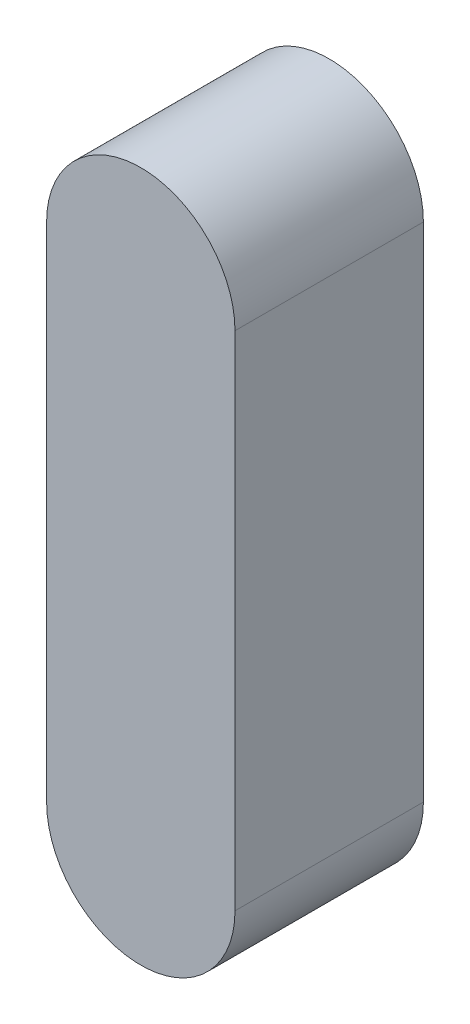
ISO-10303-21;
HEADER;
FILE_DESCRIPTION(('STEP AP214'),'2;1');
FILE_NAME('part.step','',(''),(''),'','','');
FILE_SCHEMA(('AUTOMOTIVE_DESIGN { 1 0 10303 214 1 1 1 1 }'));
ENDSEC;
DATA;
#1=APPLICATION_CONTEXT('core data for automotive mechanical design processes');
#2=APPLICATION_PROTOCOL_DEFINITION('international standard','automotive_design',2000,#1);
#3=PRODUCT_CONTEXT('',#1,'mechanical');
#4=PRODUCT('Part','Part','',(#3));
#5=PRODUCT_RELATED_PRODUCT_CATEGORY('part','',(#4));
#6=PRODUCT_DEFINITION_FORMATION('','',#4);
#7=PRODUCT_DEFINITION_CONTEXT('part definition',#1,'design');
#8=PRODUCT_DEFINITION('design','',#6,#7);
#9=PRODUCT_DEFINITION_SHAPE('','',#8);
#10=(LENGTH_UNIT() NAMED_UNIT(*) SI_UNIT(.MILLI.,.METRE.));
#11=(NAMED_UNIT(*) PLANE_ANGLE_UNIT() SI_UNIT($,.RADIAN.));
#12=(NAMED_UNIT(*) SI_UNIT($,.STERADIAN.) SOLID_ANGLE_UNIT());
#13=UNCERTAINTY_MEASURE_WITH_UNIT(LENGTH_MEASURE(1.E-05),#10,'distance_accuracy_value','');
#14=(GEOMETRIC_REPRESENTATION_CONTEXT(3) GLOBAL_UNCERTAINTY_ASSIGNED_CONTEXT((#13)) GLOBAL_UNIT_ASSIGNED_CONTEXT((#10,
#11,#12)) REPRESENTATION_CONTEXT('',''));
#15=CARTESIAN_POINT('',(0.,0.,0.));
#16=DIRECTION('',(0.,0.,1.));
#17=DIRECTION('',(1.,0.,0.));
#18=AXIS2_PLACEMENT_3D('',#15,#16,#17);
#19=CARTESIAN_POINT('',(0.,8.00000000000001,3.));
#20=DIRECTION('',(0.,0.,-1.));
#21=DIRECTION('',(-1.,0.,0.));
#22=AXIS2_PLACEMENT_3D('',#19,#20,#21);
#23=CYLINDRICAL_SURFACE('',#22,1.5);
#24=CARTESIAN_POINT('',(0.,8.00000000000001,0.));
#25=DIRECTION('',(0.,0.,1.));
#26=DIRECTION('',(1.,0.,0.));
#27=AXIS2_PLACEMENT_3D('',#24,#25,#26);
#28=CIRCLE('',#27,1.5);
#29=CARTESIAN_POINT('',(1.5,8.00000000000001,0.));
#30=VERTEX_POINT('',#29);
#31=CARTESIAN_POINT('',(-1.5,8.00000000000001,0.));
#32=VERTEX_POINT('',#31);
#33=EDGE_CURVE('E78',#30,#32,#28,.T.);
#34=ORIENTED_EDGE('',*,*,#33,.T.);
#35=DIRECTION('',(0.,0.,-1.));
#36=VECTOR('',#35,1.);
#37=CARTESIAN_POINT('',(-1.5,8.00000000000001,3.));
#38=LINE('',#37,#36);
#39=CARTESIAN_POINT('',(-1.5,8.00000000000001,3.));
#40=VERTEX_POINT('',#39);
#41=EDGE_CURVE('E11',#40,#32,#38,.T.);
#42=ORIENTED_EDGE('',*,*,#41,.F.);
#43=CARTESIAN_POINT('',(0.,8.00000000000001,3.));
#44=DIRECTION('',(0.,0.,1.));
#45=DIRECTION('',(1.,0.,0.));
#46=AXIS2_PLACEMENT_3D('',#43,#44,#45);
#47=CIRCLE('',#46,1.5);
#48=CARTESIAN_POINT('',(1.5,8.00000000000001,3.));
#49=VERTEX_POINT('',#48);
#50=EDGE_CURVE('E96',#49,#40,#47,.T.);
#51=ORIENTED_EDGE('',*,*,#50,.F.);
#52=DIRECTION('',(0.,0.,-1.));
#53=VECTOR('',#52,1.);
#54=CARTESIAN_POINT('',(1.5,8.00000000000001,3.));
#55=LINE('',#54,#53);
#56=EDGE_CURVE('E90',#49,#30,#55,.T.);
#57=ORIENTED_EDGE('',*,*,#56,.T.);
#58=EDGE_LOOP('',(#34,#42,#51,#57));
#59=FACE_BOUND('',#58,.T.);
#60=ADVANCED_FACE('F34',(#59),#23,.T.);
#61=CARTESIAN_POINT('',(-1.5,8.00000000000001,3.));
#62=DIRECTION('',(1.,0.,0.));
#63=DIRECTION('',(0.,0.,-1.));
#64=AXIS2_PLACEMENT_3D('',#61,#62,#63);
#65=PLANE('',#64);
#66=DIRECTION('',(0.,-1.,0.));
#67=VECTOR('',#66,1.);
#68=CARTESIAN_POINT('',(-1.5,8.00000000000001,0.));
#69=LINE('',#68,#67);
#70=CARTESIAN_POINT('',(-1.5,0.,0.));
#71=VERTEX_POINT('',#70);
#72=EDGE_CURVE('E74',#32,#71,#69,.T.);
#73=ORIENTED_EDGE('',*,*,#72,.T.);
#74=DIRECTION('',(0.,0.,-1.));
#75=VECTOR('',#74,1.);
#76=CARTESIAN_POINT('',(-1.5,0.,3.));
#77=LINE('',#76,#75);
#78=CARTESIAN_POINT('',(-1.5,0.,3.));
#79=VERTEX_POINT('',#78);
#80=EDGE_CURVE('E41',#79,#71,#77,.T.);
#81=ORIENTED_EDGE('',*,*,#80,.F.);
#82=DIRECTION('',(0.,-1.,0.));
#83=VECTOR('',#82,1.);
#84=CARTESIAN_POINT('',(-1.5,8.00000000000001,3.));
#85=LINE('',#84,#83);
#86=EDGE_CURVE('E86',#40,#79,#85,.T.);
#87=ORIENTED_EDGE('',*,*,#86,.F.);
#88=ORIENTED_EDGE('',*,*,#41,.T.);
#89=EDGE_LOOP('',(#73,#81,#87,#88));
#90=FACE_BOUND('',#89,.T.);
#91=ADVANCED_FACE('F85',(#90),#65,.F.);
#92=CARTESIAN_POINT('',(0.,0.,3.));
#93=DIRECTION('',(0.,0.,-1.));
#94=DIRECTION('',(-1.,0.,0.));
#95=AXIS2_PLACEMENT_3D('',#92,#93,#94);
#96=CYLINDRICAL_SURFACE('',#95,1.5);
#97=CARTESIAN_POINT('',(0.,0.,0.));
#98=DIRECTION('',(0.,0.,1.));
#99=DIRECTION('',(1.,0.,0.));
#100=AXIS2_PLACEMENT_3D('',#97,#98,#99);
#101=CIRCLE('',#100,1.5);
#102=CARTESIAN_POINT('',(1.5,0.,0.));
#103=VERTEX_POINT('',#102);
#104=EDGE_CURVE('E79',#71,#103,#101,.T.);
#105=ORIENTED_EDGE('',*,*,#104,.T.);
#106=DIRECTION('',(0.,0.,-1.));
#107=VECTOR('',#106,1.);
#108=CARTESIAN_POINT('',(1.5,0.,3.));
#109=LINE('',#108,#107);
#110=CARTESIAN_POINT('',(1.5,0.,3.));
#111=VERTEX_POINT('',#110);
#112=EDGE_CURVE('E102',#111,#103,#109,.T.);
#113=ORIENTED_EDGE('',*,*,#112,.F.);
#114=CARTESIAN_POINT('',(0.,0.,3.));
#115=DIRECTION('',(0.,0.,1.));
#116=DIRECTION('',(1.,0.,0.));
#117=AXIS2_PLACEMENT_3D('',#114,#115,#116);
#118=CIRCLE('',#117,1.5);
#119=EDGE_CURVE('E53',#79,#111,#118,.T.);
#120=ORIENTED_EDGE('',*,*,#119,.F.);
#121=ORIENTED_EDGE('',*,*,#80,.T.);
#122=EDGE_LOOP('',(#105,#113,#120,#121));
#123=FACE_BOUND('',#122,.T.);
#124=ADVANCED_FACE('F105',(#123),#96,.T.);
#125=CARTESIAN_POINT('',(1.5,8.00000000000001,3.));
#126=DIRECTION('',(-1.,0.,0.));
#127=DIRECTION('',(0.,0.,1.));
#128=AXIS2_PLACEMENT_3D('',#125,#126,#127);
#129=PLANE('',#128);
#130=DIRECTION('',(0.,1.,0.));
#131=VECTOR('',#130,1.);
#132=CARTESIAN_POINT('',(1.5,8.00000000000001,0.));
#133=LINE('',#132,#131);
#134=EDGE_CURVE('E94',#103,#30,#133,.T.);
#135=ORIENTED_EDGE('',*,*,#134,.T.);
#136=ORIENTED_EDGE('',*,*,#56,.F.);
#137=DIRECTION('',(0.,1.,0.));
#138=VECTOR('',#137,1.);
#139=CARTESIAN_POINT('',(1.5,8.00000000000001,3.));
#140=LINE('',#139,#138);
#141=EDGE_CURVE('E48',#111,#49,#140,.T.);
#142=ORIENTED_EDGE('',*,*,#141,.F.);
#143=ORIENTED_EDGE('',*,*,#112,.T.);
#144=EDGE_LOOP('',(#135,#136,#142,#143));
#145=FACE_BOUND('',#144,.T.);
#146=ADVANCED_FACE('F107',(#145),#129,.F.);
#147=CARTESIAN_POINT('',(0.,8.00000000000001,3.));
#148=DIRECTION('',(0.,0.,1.));
#149=DIRECTION('',(1.,0.,0.));
#150=AXIS2_PLACEMENT_3D('',#147,#148,#149);
#151=PLANE('',#150);
#152=ORIENTED_EDGE('',*,*,#50,.T.);
#153=ORIENTED_EDGE('',*,*,#86,.T.);
#154=ORIENTED_EDGE('',*,*,#119,.T.);
#155=ORIENTED_EDGE('',*,*,#141,.T.);
#156=EDGE_LOOP('',(#152,#153,#154,#155));
#157=FACE_BOUND('',#156,.T.);
#158=ADVANCED_FACE('F108',(#157),#151,.T.);
#159=CARTESIAN_POINT('',(0.,8.00000000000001,0.));
#160=DIRECTION('',(0.,0.,1.));
#161=DIRECTION('',(1.,0.,0.));
#162=AXIS2_PLACEMENT_3D('',#159,#160,#161);
#163=PLANE('',#162);
#164=ORIENTED_EDGE('',*,*,#33,.F.);
#165=ORIENTED_EDGE('',*,*,#134,.F.);
#166=ORIENTED_EDGE('',*,*,#104,.F.);
#167=ORIENTED_EDGE('',*,*,#72,.F.);
#168=EDGE_LOOP('',(#164,#165,#166,#167));
#169=FACE_BOUND('',#168,.T.);
#170=ADVANCED_FACE('F75',(#169),#163,.F.);
#171=CLOSED_SHELL('',(#60,#91,#124,#146,#158,#170));
#172=MANIFOLD_SOLID_BREP('B2',#171);
#173=ADVANCED_BREP_SHAPE_REPRESENTATION('',(#18,#172),#14);
#174=SHAPE_DEFINITION_REPRESENTATION(#9,#173);
ENDSEC;
END-ISO-10303-21;
